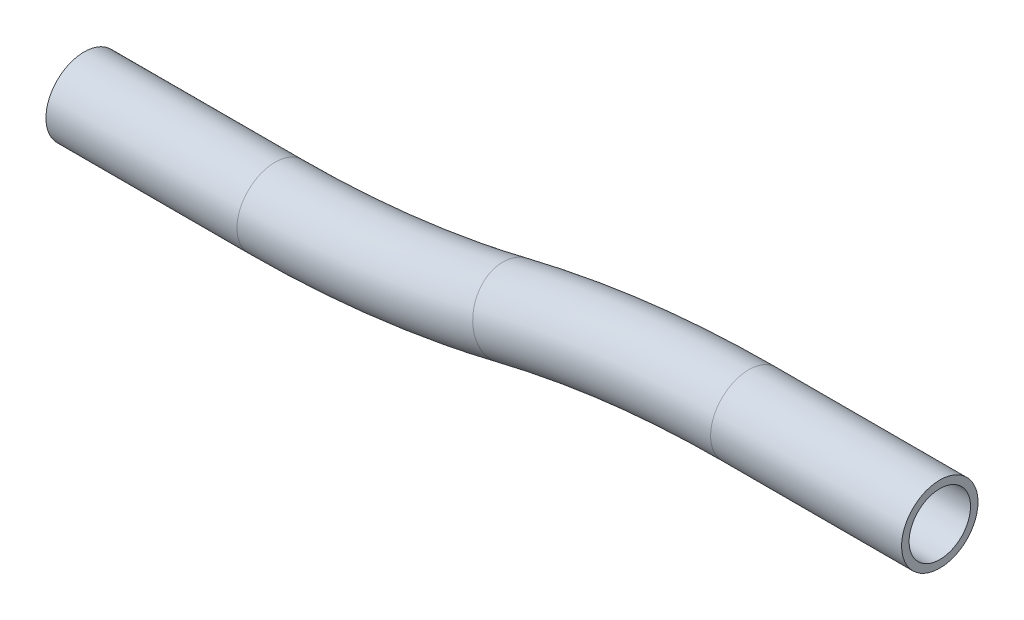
from build123d import *

# Parameters (mm, degrees)
SKETCH1_R   = 6.35
SKETCH1_R_2 = 5.1054


with BuildPart() as part:
    # Sweep1: sweep along a path in Sketch2
    with BuildLine(Plane.XY) as sweep1_path:
        Line((0, 0), (31.75, 0))
        ThreePointArc((31.75, 0), (51.577456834, 1.190533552), (71.12, 4.745026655))
        ThreePointArc((71.12, 4.745026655), (90.662543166, 8.299519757), (110.49, 9.490053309))
        Line((110.49, 9.490053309), (142.24, 9.490053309))
    # Sketch1 → Sweep1 (sweep)
    with BuildSketch(Plane(origin=(0, 0, 0), x_dir=(0, 0, -1), z_dir=(1, 0, 0))):
        Circle(SKETCH1_R)
        Circle(SKETCH1_R_2, mode=Mode.SUBTRACT)
    sweep(path=sweep1_path.line)


solid = part.part
